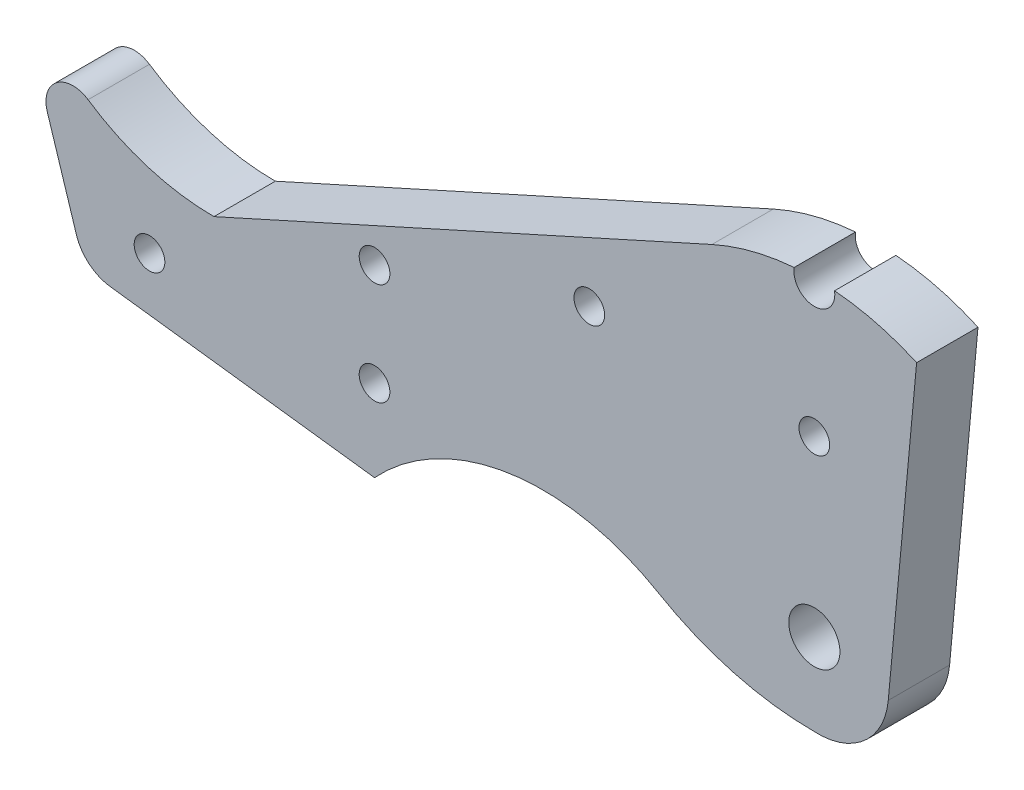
from build123d import *

# Parameters (mm, degrees)
SKETCH1_R      = 1.5
SKETCH1_R_2    = 2.5
EXTRUDE1_DEPTH = 6


with BuildPart() as part:
    # Sketch1 → Extrude1 (new body)
    with BuildSketch(Plane.XY):
        with BuildLine():
            Line((85, 36.239858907), (82.226631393, 6.257495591))
            ThreePointArc((82.226631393, 6.257495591), (79.871891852, 1.675248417), (75, 0))
            ThreePointArc((75, 0), (67.09494224, 1.051729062), (59.739858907, 4.133744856))
            ThreePointArc((59.739858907, 4.133744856), (45.142283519, 6.949804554), (32, 0))
            Line((32, 0), (6.14638448, 3.259259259))
            ThreePointArc((6.14638448, 3.259259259), (3.995128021, 4.235535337), (2.773368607, 6.257495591))
            Line((2.773368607, 6.257495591), (0, 15.002351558))
            ThreePointArc((0, 15.002351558), (0.934093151, 17.918520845), (3.995128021, 18))
            ThreePointArc((3.995128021, 18), (9.871467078, 15.212943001), (16.304502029, 14.256329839))
            Line((16.304502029, 14.256329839), (64.986772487, 36.239858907))
            ThreePointArc((64.986772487, 36.239858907), (68.916634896, 37.622847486), (73.024905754, 38.314646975))
            ThreePointArc((73.024905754, 38.314646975), (74.999447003, 36.000000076), (76.975267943, 38.313554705))
            ThreePointArc((76.975267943, 38.313554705), (81.076646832, 37.621166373), (85, 36.239858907))
        make_face()
        with Locations((75, 25)):
            Circle(SKETCH1_R, mode=Mode.SUBTRACT)
        with Locations((75, 8)):
            Circle(SKETCH1_R_2, mode=Mode.SUBTRACT)
        with Locations((53, 25)):
            Circle(SKETCH1_R, mode=Mode.SUBTRACT)
        with Locations((32, 18)):
            Circle(SKETCH1_R, mode=Mode.SUBTRACT)
        with Locations((32, 8)):
            Circle(SKETCH1_R, mode=Mode.SUBTRACT)
        with Locations((10, 8)):
            Circle(SKETCH1_R, mode=Mode.SUBTRACT)
    extrude(amount=EXTRUDE1_DEPTH)


solid = part.part
